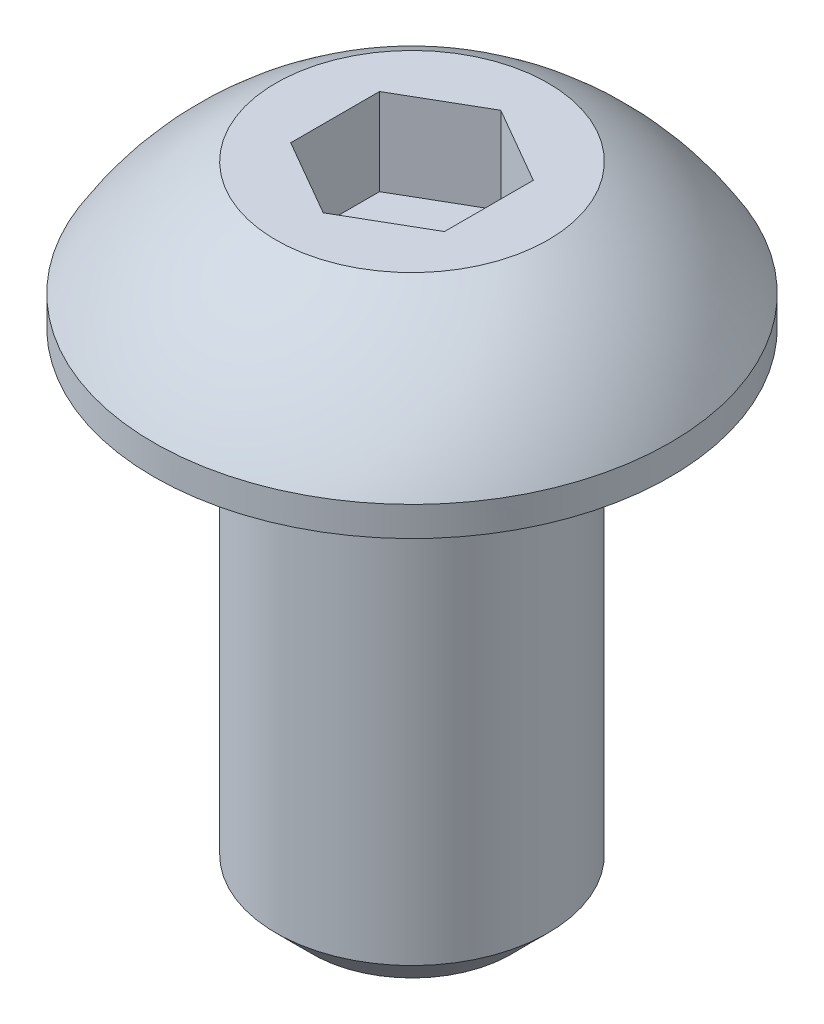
ISO-10303-21;
HEADER;
FILE_DESCRIPTION(('STEP AP214'),'2;1');
FILE_NAME('part.step','',(''),(''),'','','');
FILE_SCHEMA(('AUTOMOTIVE_DESIGN { 1 0 10303 214 1 1 1 1 }'));
ENDSEC;
DATA;
#1=APPLICATION_CONTEXT('core data for automotive mechanical design processes');
#2=APPLICATION_PROTOCOL_DEFINITION('international standard','automotive_design',2000,#1);
#3=PRODUCT_CONTEXT('',#1,'mechanical');
#4=PRODUCT('Part','Part','',(#3));
#5=PRODUCT_RELATED_PRODUCT_CATEGORY('part','',(#4));
#6=PRODUCT_DEFINITION_FORMATION('','',#4);
#7=PRODUCT_DEFINITION_CONTEXT('part definition',#1,'design');
#8=PRODUCT_DEFINITION('design','',#6,#7);
#9=PRODUCT_DEFINITION_SHAPE('','',#8);
#10=(LENGTH_UNIT() NAMED_UNIT(*) SI_UNIT(.MILLI.,.METRE.));
#11=(NAMED_UNIT(*) PLANE_ANGLE_UNIT() SI_UNIT($,.RADIAN.));
#12=(NAMED_UNIT(*) SI_UNIT($,.STERADIAN.) SOLID_ANGLE_UNIT());
#13=UNCERTAINTY_MEASURE_WITH_UNIT(LENGTH_MEASURE(1.E-05),#10,'distance_accuracy_value','');
#14=(GEOMETRIC_REPRESENTATION_CONTEXT(3) GLOBAL_UNCERTAINTY_ASSIGNED_CONTEXT((#13)) GLOBAL_UNIT_ASSIGNED_CONTEXT((#10,
#11,#12)) REPRESENTATION_CONTEXT('',''));
#15=CARTESIAN_POINT('',(0.,0.,0.));
#16=DIRECTION('',(0.,0.,1.));
#17=DIRECTION('',(1.,0.,0.));
#18=AXIS2_PLACEMENT_3D('',#15,#16,#17);
#19=CARTESIAN_POINT('',(0.,0.,0.));
#20=DIRECTION('',(0.,-1.,0.));
#21=DIRECTION('',(0.,0.,-1.));
#22=AXIS2_PLACEMENT_3D('',#19,#20,#21);
#23=PLANE('',#22);
#24=CARTESIAN_POINT('',(0.,0.,0.));
#25=DIRECTION('',(0.,-1.,0.));
#26=DIRECTION('',(0.,0.,-1.));
#27=AXIS2_PLACEMENT_3D('',#24,#25,#26);
#28=CIRCLE('',#27,1.752598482);
#29=CARTESIAN_POINT('',(0.,0.,-1.752598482));
#30=VERTEX_POINT('',#29);
#31=EDGE_CURVE('E11',#30,#30,#28,.T.);
#32=ORIENTED_EDGE('',*,*,#31,.F.);
#33=EDGE_LOOP('',(#32));
#34=FACE_BOUND('',#33,.T.);
#35=CARTESIAN_POINT('',(0.,0.,0.));
#36=DIRECTION('',(0.,-1.,0.));
#37=DIRECTION('',(0.,0.,-1.));
#38=AXIS2_PLACEMENT_3D('',#35,#36,#37);
#39=CIRCLE('',#38,3.327397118);
#40=CARTESIAN_POINT('',(0.,0.,-3.327397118));
#41=VERTEX_POINT('',#40);
#42=EDGE_CURVE('E35',#41,#41,#39,.T.);
#43=ORIENTED_EDGE('',*,*,#42,.T.);
#44=EDGE_LOOP('',(#43));
#45=FACE_BOUND('',#44,.T.);
#46=ADVANCED_FACE('F28',(#34,#45),#23,.T.);
#47=CARTESIAN_POINT('',(0.,0.,0.));
#48=DIRECTION('',(0.,-1.,0.));
#49=DIRECTION('',(0.,0.,-1.));
#50=AXIS2_PLACEMENT_3D('',#47,#48,#49);
#51=CYLINDRICAL_SURFACE('',#50,3.327397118);
#52=CARTESIAN_POINT('',(0.,0.38099967,0.));
#53=DIRECTION('',(0.,-1.,0.));
#54=DIRECTION('',(0.,0.,-1.));
#55=AXIS2_PLACEMENT_3D('',#52,#53,#54);
#56=CIRCLE('',#55,3.327397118);
#57=CARTESIAN_POINT('',(3.327397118,0.38099967,0.));
#58=VERTEX_POINT('',#57);
#59=EDGE_CURVE('E145',#58,#58,#56,.T.);
#60=ORIENTED_EDGE('',*,*,#59,.T.);
#61=EDGE_LOOP('',(#60));
#62=FACE_BOUND('',#61,.T.);
#63=ORIENTED_EDGE('',*,*,#42,.F.);
#64=EDGE_LOOP('',(#63));
#65=FACE_BOUND('',#64,.T.);
#66=ADVANCED_FACE('F151',(#62,#65),#51,.T.);
#67=CARTESIAN_POINT('',(0.,-1.59757103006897,0.));
#68=DIRECTION('',(0.,-1.,0.));
#69=DIRECTION('',(1.,0.,0.));
#70=AXIS2_PLACEMENT_3D('',#67,#68,#69);
#71=SPHERICAL_SURFACE('',#70,3.87121603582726);
#72=CARTESIAN_POINT('',(0.,1.854198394,0.));
#73=DIRECTION('',(0.,-1.,0.));
#74=DIRECTION('',(0.,0.,-1.));
#75=AXIS2_PLACEMENT_3D('',#72,#73,#74);
#76=CIRCLE('',#75,1.752598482);
#77=CARTESIAN_POINT('',(1.752598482,1.854198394,0.));
#78=VERTEX_POINT('',#77);
#79=EDGE_CURVE('E142',#78,#78,#76,.T.);
#80=CARTESIAN_POINT('',(1.752598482,1.854198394,0.));
#81=CARTESIAN_POINT('',(1.77289614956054,1.84389249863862,0.));
#82=CARTESIAN_POINT('',(1.79310289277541,1.833407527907,0.));
#83=CARTESIAN_POINT('',(1.83332828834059,1.81208278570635,0.));
#84=CARTESIAN_POINT('',(1.85334694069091,1.80124301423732,0.));
#85=CARTESIAN_POINT('',(1.89318991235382,1.77921202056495,0.));
#86=CARTESIAN_POINT('',(1.91301423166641,1.76802079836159,0.));
#87=CARTESIAN_POINT('',(1.95246237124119,1.74529039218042,0.));
#88=CARTESIAN_POINT('',(1.97208619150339,1.7337512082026,0.));
#89=CARTESIAN_POINT('',(2.01112722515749,1.71032846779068,0.));
#90=CARTESIAN_POINT('',(2.0305444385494,1.69844491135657,0.));
#91=CARTESIAN_POINT('',(2.06916621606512,1.67433712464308,0.));
#92=CARTESIAN_POINT('',(2.08837078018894,1.66211289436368,0.));
#93=CARTESIAN_POINT('',(2.12656128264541,1.63732756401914,0.));
#94=CARTESIAN_POINT('',(2.14554722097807,1.62476646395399,0.));
#95=CARTESIAN_POINT('',(2.18329456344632,1.5993113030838,0.));
#96=CARTESIAN_POINT('',(2.20205596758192,1.58641724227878,0.));
#97=CARTESIAN_POINT('',(2.23934840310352,1.56030017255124,0.));
#98=CARTESIAN_POINT('',(2.25787943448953,1.54707716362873,0.));
#99=CARTESIAN_POINT('',(2.29470535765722,1.52030631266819,0.));
#100=CARTESIAN_POINT('',(2.3130002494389,1.50675847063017,0.));
#101=CARTESIAN_POINT('',(2.34934820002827,1.47934216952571,0.));
#102=CARTESIAN_POINT('',(2.36740125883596,1.46547371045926,0.));
#103=CARTESIAN_POINT('',(2.40325992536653,1.43742049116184,0.));
#104=CARTESIAN_POINT('',(2.4210655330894,1.42323573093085,0.));
#105=CARTESIAN_POINT('',(2.45642375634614,1.3945543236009,0.));
#106=CARTESIAN_POINT('',(2.47397637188,1.38005767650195,0.));
#107=CARTESIAN_POINT('',(2.50882314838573,1.35075700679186,0.));
#108=CARTESIAN_POINT('',(2.52611730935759,1.33595298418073,0.));
#109=CARTESIAN_POINT('',(2.56044179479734,1.30604217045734,0.));
#110=CARTESIAN_POINT('',(2.57747211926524,1.29093537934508,0.));
#111=CARTESIAN_POINT('',(2.61126363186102,1.260423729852,0.));
#112=CARTESIAN_POINT('',(2.6280248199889,1.24501887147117,0.));
#113=CARTESIAN_POINT('',(2.66127284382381,1.21391588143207,0.));
#114=CARTESIAN_POINT('',(2.67775967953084,1.19821774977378,0.));
#115=CARTESIAN_POINT('',(2.71045386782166,1.16653309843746,0.));
#116=CARTESIAN_POINT('',(2.72666122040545,1.15054657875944,0.));
#117=CARTESIAN_POINT('',(2.75879139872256,1.11829012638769,0.));
#118=CARTESIAN_POINT('',(2.77471422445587,1.10202019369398,0.));
#119=CARTESIAN_POINT('',(2.80627039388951,1.06920197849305,0.));
#120=CARTESIAN_POINT('',(2.82190373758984,1.05265369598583,0.));
#121=CARTESIAN_POINT('',(2.85287607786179,1.01928393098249,0.));
#122=CARTESIAN_POINT('',(2.86821507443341,1.00246244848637,0.));
#123=CARTESIAN_POINT('',(2.89859394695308,0.968551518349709,0.));
#124=CARTESIAN_POINT('',(2.91363382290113,0.951462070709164,0.));
#125=CARTESIAN_POINT('',(2.94340977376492,0.917020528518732,0.));
#126=CARTESIAN_POINT('',(2.95814584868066,0.899668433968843,0.));
#127=CARTESIAN_POINT('',(2.98730961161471,0.864706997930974,0.));
#128=CARTESIAN_POINT('',(3.00173729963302,0.847097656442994,0.));
#129=CARTESIAN_POINT('',(3.03027979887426,0.811627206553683,0.));
#130=CARTESIAN_POINT('',(3.04439461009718,0.793766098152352,0.));
#131=CARTESIAN_POINT('',(3.07230696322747,0.757797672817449,0.));
#132=CARTESIAN_POINT('',(3.08610450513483,0.739690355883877,0.));
#133=CARTESIAN_POINT('',(3.11337802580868,0.703235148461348,0.));
#134=CARTESIAN_POINT('',(3.12685400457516,0.684887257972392,0.));
#135=CARTESIAN_POINT('',(3.15348020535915,0.647956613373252,0.));
#136=CARTESIAN_POINT('',(3.16663042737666,0.629373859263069,0.));
#137=CARTESIAN_POINT('',(3.19260102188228,0.591979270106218,0.));
#138=CARTESIAN_POINT('',(3.2054213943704,0.573167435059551,0.));
#139=CARTESIAN_POINT('',(3.2307283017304,0.535320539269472,0.));
#140=CARTESIAN_POINT('',(3.24321483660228,0.516285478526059,0.));
#141=CARTESIAN_POINT('',(3.26785017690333,0.477998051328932,0.));
#142=CARTESIAN_POINT('',(3.27999898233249,0.458745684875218,0.));
#143=CARTESIAN_POINT('',(3.30395510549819,0.420029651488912,0.));
#144=CARTESIAN_POINT('',(3.31576242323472,0.400565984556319,0.));
#145=CARTESIAN_POINT('',(3.327397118,0.38099967,0.));
#146=B_SPLINE_CURVE_WITH_KNOTS('',3,(#80,#81,#82,#83,#84,#85,#86,#87,#88,#89,#90,#91,#92,#93,
#94,#95,#96,#97,#98,#99,#100,#101,#102,#103,#104,#105,#106,#107,#108,#109,#110,#111,#112,#113,
#114,#115,#116,#117,#118,#119,#120,#121,#122,#123,#124,#125,#126,#127,#128,#129,#130,#131,#132,
#133,#134,#135,#136,#137,#138,#139,#140,#141,#142,#143,#144,#145),.UNSPECIFIED.,.F.,.F.,(4,2,2,
2,2,2,2,2,2,2,2,2,2,2,2,2,2,2,2,2,2,2,2,2,2,2,2,2,2,2,2,2,4),(0.,0.0682915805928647,
0.136583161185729,0.204874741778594,0.273166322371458,0.341457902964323,0.409749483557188,
0.478041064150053,0.546332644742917,0.614624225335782,0.682915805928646,0.751207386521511,
0.819498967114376,0.88779054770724,0.956082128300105,1.02437370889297,1.09266528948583,
1.1609568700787,1.22924845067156,1.29754003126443,1.36583161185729,1.43412319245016,
1.50241477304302,1.57070635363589,1.63899793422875,1.70728951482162,1.77558109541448,
1.84387267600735,1.91216425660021,1.98045583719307,2.04874741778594,2.1170389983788,
2.18533057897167),.UNSPECIFIED.);
#147=EDGE_CURVE('BSEAM153',#78,#58,#146,.T.);
#148=ORIENTED_EDGE('',*,*,#79,.T.);
#149=ORIENTED_EDGE('',*,*,#59,.F.);
#150=ORIENTED_EDGE('',*,*,#147,.T.);
#151=ORIENTED_EDGE('',*,*,#147,.F.);
#152=EDGE_LOOP('',(#148,#150,#149,#151));
#153=FACE_BOUND('',#152,.T.);
#154=ADVANCED_FACE('F153',(#153),#71,.T.);
#155=CARTESIAN_POINT('',(1.752598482,1.854198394,0.));
#156=DIRECTION('',(0.,1.,0.));
#157=DIRECTION('',(0.,0.,1.));
#158=AXIS2_PLACEMENT_3D('',#155,#156,#157);
#159=PLANE('',#158);
#160=DIRECTION('',(0.,0.,1.));
#161=VECTOR('',#160,1.);
#162=CARTESIAN_POINT('',(-0.990599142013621,1.854198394,-0.57192268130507));
#163=LINE('',#162,#161);
#164=CARTESIAN_POINT('',(-0.990599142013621,1.854198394,-0.57192268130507));
#165=VERTEX_POINT('',#164);
#166=CARTESIAN_POINT('',(-0.990599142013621,1.854198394,0.571922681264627));
#167=VERTEX_POINT('',#166);
#168=EDGE_CURVE('E42',#165,#167,#163,.T.);
#169=ORIENTED_EDGE('',*,*,#168,.F.);
#170=DIRECTION('',(-0.866025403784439,0.,0.5));
#171=VECTOR('',#170,1.);
#172=CARTESIAN_POINT('',(-9.72916336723E-12,1.854198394,-1.14384536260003));
#173=LINE('',#172,#171);
#174=CARTESIAN_POINT('',(-9.72916336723E-12,1.854198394,-1.14384536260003));
#175=VERTEX_POINT('',#174);
#176=EDGE_CURVE('E112',#175,#165,#173,.T.);
#177=ORIENTED_EDGE('',*,*,#176,.F.);
#178=DIRECTION('',(-0.866025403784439,0.,-0.5));
#179=VECTOR('',#178,1.);
#180=CARTESIAN_POINT('',(0.990599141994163,1.854198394,-0.57192268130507));
#181=LINE('',#180,#179);
#182=CARTESIAN_POINT('',(0.990599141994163,1.854198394,-0.57192268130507));
#183=VERTEX_POINT('',#182);
#184=EDGE_CURVE('E106',#183,#175,#181,.T.);
#185=ORIENTED_EDGE('',*,*,#184,.F.);
#186=DIRECTION('',(0.,0.,-1.));
#187=VECTOR('',#186,1.);
#188=CARTESIAN_POINT('',(0.990599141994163,1.854198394,0.571922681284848));
#189=LINE('',#188,#187);
#190=CARTESIAN_POINT('',(0.990599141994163,1.854198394,0.571922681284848));
#191=VERTEX_POINT('',#190);
#192=EDGE_CURVE('E104',#191,#183,#189,.T.);
#193=ORIENTED_EDGE('',*,*,#192,.F.);
#194=DIRECTION('',(0.866025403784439,0.,-0.5));
#195=VECTOR('',#194,1.);
#196=CARTESIAN_POINT('',(-9.72908120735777E-12,1.854198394,1.14384536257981));
#197=LINE('',#196,#195);
#198=CARTESIAN_POINT('',(-9.72908120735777E-12,1.854198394,1.14384536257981));
#199=VERTEX_POINT('',#198);
#200=EDGE_CURVE('E85',#199,#191,#197,.T.);
#201=ORIENTED_EDGE('',*,*,#200,.F.);
#202=DIRECTION('',(0.866025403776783,0.,0.500000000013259));
#203=VECTOR('',#202,1.);
#204=CARTESIAN_POINT('',(-0.990599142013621,1.854198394,0.571922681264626));
#205=LINE('',#204,#203);
#206=EDGE_CURVE('E96',#167,#199,#205,.T.);
#207=ORIENTED_EDGE('',*,*,#206,.F.);
#208=EDGE_LOOP('',(#169,#177,#185,#193,#201,#207));
#209=FACE_BOUND('',#208,.T.);
#210=ORIENTED_EDGE('',*,*,#79,.F.);
#211=EDGE_LOOP('',(#210));
#212=FACE_BOUND('',#211,.T.);
#213=ADVANCED_FACE('F100',(#209,#212),#159,.T.);
#214=CARTESIAN_POINT('',(0.,-6.3499945,0.));
#215=DIRECTION('',(0.,-1.,0.));
#216=DIRECTION('',(0.,0.,-1.));
#217=AXIS2_PLACEMENT_3D('',#214,#215,#216);
#218=PLANE('',#217);
#219=CARTESIAN_POINT('',(0.,-6.3499945,0.));
#220=DIRECTION('',(0.,-1.,0.));
#221=DIRECTION('',(0.,0.,-1.));
#222=AXIS2_PLACEMENT_3D('',#219,#220,#221);
#223=CIRCLE('',#222,1.2801588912);
#224=CARTESIAN_POINT('',(0.,-6.3499945,-1.2801588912));
#225=VERTEX_POINT('',#224);
#226=EDGE_CURVE('E139',#225,#225,#223,.T.);
#227=ORIENTED_EDGE('',*,*,#226,.T.);
#228=EDGE_LOOP('',(#227));
#229=FACE_BOUND('',#228,.T.);
#230=ADVANCED_FACE('F165',(#229),#218,.T.);
#231=CARTESIAN_POINT('',(0.,-6.3499945,0.));
#232=DIRECTION('',(0.,1.,0.));
#233=DIRECTION('',(0.,0.,1.));
#234=AXIS2_PLACEMENT_3D('',#231,#232,#233);
#235=CONICAL_SURFACE('',#234,1.2801588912,0.785398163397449);
#236=CARTESIAN_POINT('',(0.,-5.8775549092,0.));
#237=DIRECTION('',(0.,-1.,0.));
#238=DIRECTION('',(0.,0.,-1.));
#239=AXIS2_PLACEMENT_3D('',#236,#237,#238);
#240=CIRCLE('',#239,1.752598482);
#241=CARTESIAN_POINT('',(0.,-5.8775549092,-1.752598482));
#242=VERTEX_POINT('',#241);
#243=EDGE_CURVE('E130',#242,#242,#240,.T.);
#244=ORIENTED_EDGE('',*,*,#243,.T.);
#245=EDGE_LOOP('',(#244));
#246=FACE_BOUND('',#245,.T.);
#247=ORIENTED_EDGE('',*,*,#226,.F.);
#248=EDGE_LOOP('',(#247));
#249=FACE_BOUND('',#248,.T.);
#250=ADVANCED_FACE('F168',(#246,#249),#235,.T.);
#251=CARTESIAN_POINT('',(0.,0.,0.));
#252=DIRECTION('',(0.,-1.,0.));
#253=DIRECTION('',(0.,0.,-1.));
#254=AXIS2_PLACEMENT_3D('',#251,#252,#253);
#255=CYLINDRICAL_SURFACE('',#254,1.752598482);
#256=ORIENTED_EDGE('',*,*,#31,.T.);
#257=EDGE_LOOP('',(#256));
#258=FACE_BOUND('',#257,.T.);
#259=ORIENTED_EDGE('',*,*,#243,.F.);
#260=EDGE_LOOP('',(#259));
#261=FACE_BOUND('',#260,.T.);
#262=ADVANCED_FACE('F172',(#258,#261),#255,.T.);
#263=CARTESIAN_POINT('',(-0.990599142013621,0.736599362,-0.57192268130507));
#264=DIRECTION('',(-1.,0.,0.));
#265=DIRECTION('',(0.,0.,1.));
#266=AXIS2_PLACEMENT_3D('',#263,#264,#265);
#267=PLANE('',#266);
#268=ORIENTED_EDGE('',*,*,#168,.T.);
#269=DIRECTION('',(0.,1.,0.));
#270=VECTOR('',#269,1.);
#271=CARTESIAN_POINT('',(-0.990599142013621,0.736599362,0.571922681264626));
#272=LINE('',#271,#270);
#273=CARTESIAN_POINT('',(-0.990599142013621,0.736599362,0.571922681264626));
#274=VERTEX_POINT('',#273);
#275=EDGE_CURVE('E93',#274,#167,#272,.T.);
#276=ORIENTED_EDGE('',*,*,#275,.F.);
#277=DIRECTION('',(0.,0.,1.));
#278=VECTOR('',#277,1.);
#279=CARTESIAN_POINT('',(-0.990599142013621,0.736599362,-0.57192268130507));
#280=LINE('',#279,#278);
#281=CARTESIAN_POINT('',(-0.990599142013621,0.736599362,-0.57192268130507));
#282=VERTEX_POINT('',#281);
#283=EDGE_CURVE('E114',#282,#274,#280,.T.);
#284=ORIENTED_EDGE('',*,*,#283,.F.);
#285=DIRECTION('',(0.,1.,0.));
#286=VECTOR('',#285,1.);
#287=CARTESIAN_POINT('',(-0.990599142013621,0.736599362,-0.57192268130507));
#288=LINE('',#287,#286);
#289=EDGE_CURVE('E49',#282,#165,#288,.T.);
#290=ORIENTED_EDGE('',*,*,#289,.T.);
#291=EDGE_LOOP('',(#268,#276,#284,#290));
#292=FACE_BOUND('',#291,.T.);
#293=ADVANCED_FACE('F176',(#292),#267,.F.);
#294=CARTESIAN_POINT('',(-9.72916336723E-12,0.736599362,-1.14384536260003));
#295=DIRECTION('',(-0.5,0.,-0.866025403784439));
#296=DIRECTION('',(-0.866025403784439,0.,0.5));
#297=AXIS2_PLACEMENT_3D('',#294,#295,#296);
#298=PLANE('',#297);
#299=ORIENTED_EDGE('',*,*,#176,.T.);
#300=ORIENTED_EDGE('',*,*,#289,.F.);
#301=DIRECTION('',(-0.866025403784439,0.,0.5));
#302=VECTOR('',#301,1.);
#303=CARTESIAN_POINT('',(-9.72916336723E-12,0.736599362,-1.14384536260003));
#304=LINE('',#303,#302);
#305=CARTESIAN_POINT('',(-9.72916336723E-12,0.736599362,-1.14384536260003));
#306=VERTEX_POINT('',#305);
#307=EDGE_CURVE('E126',#306,#282,#304,.T.);
#308=ORIENTED_EDGE('',*,*,#307,.F.);
#309=DIRECTION('',(0.,1.,0.));
#310=VECTOR('',#309,1.);
#311=CARTESIAN_POINT('',(-9.72916336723E-12,0.736599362,-1.14384536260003));
#312=LINE('',#311,#310);
#313=EDGE_CURVE('E131',#306,#175,#312,.T.);
#314=ORIENTED_EDGE('',*,*,#313,.T.);
#315=EDGE_LOOP('',(#299,#300,#308,#314));
#316=FACE_BOUND('',#315,.T.);
#317=ADVANCED_FACE('F180',(#316),#298,.F.);
#318=CARTESIAN_POINT('',(0.990599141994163,0.736599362,-0.57192268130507));
#319=DIRECTION('',(0.5,0.,-0.866025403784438));
#320=DIRECTION('',(-0.866025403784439,0.,-0.5));
#321=AXIS2_PLACEMENT_3D('',#318,#319,#320);
#322=PLANE('',#321);
#323=ORIENTED_EDGE('',*,*,#184,.T.);
#324=ORIENTED_EDGE('',*,*,#313,.F.);
#325=DIRECTION('',(-0.866025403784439,0.,-0.5));
#326=VECTOR('',#325,1.);
#327=CARTESIAN_POINT('',(0.990599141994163,0.736599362,-0.57192268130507));
#328=LINE('',#327,#326);
#329=CARTESIAN_POINT('',(0.990599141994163,0.736599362,-0.57192268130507));
#330=VERTEX_POINT('',#329);
#331=EDGE_CURVE('E123',#330,#306,#328,.T.);
#332=ORIENTED_EDGE('',*,*,#331,.F.);
#333=DIRECTION('',(0.,1.,0.));
#334=VECTOR('',#333,1.);
#335=CARTESIAN_POINT('',(0.990599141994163,0.736599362,-0.57192268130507));
#336=LINE('',#335,#334);
#337=EDGE_CURVE('E133',#330,#183,#336,.T.);
#338=ORIENTED_EDGE('',*,*,#337,.T.);
#339=EDGE_LOOP('',(#323,#324,#332,#338));
#340=FACE_BOUND('',#339,.T.);
#341=ADVANCED_FACE('F189',(#340),#322,.F.);
#342=CARTESIAN_POINT('',(0.990599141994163,0.736599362,0.571922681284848));
#343=DIRECTION('',(1.,0.,0.));
#344=DIRECTION('',(0.,0.,-1.));
#345=AXIS2_PLACEMENT_3D('',#342,#343,#344);
#346=PLANE('',#345);
#347=ORIENTED_EDGE('',*,*,#192,.T.);
#348=ORIENTED_EDGE('',*,*,#337,.F.);
#349=DIRECTION('',(0.,0.,-1.));
#350=VECTOR('',#349,1.);
#351=CARTESIAN_POINT('',(0.990599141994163,0.736599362,0.571922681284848));
#352=LINE('',#351,#350);
#353=CARTESIAN_POINT('',(0.990599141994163,0.736599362,0.571922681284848));
#354=VERTEX_POINT('',#353);
#355=EDGE_CURVE('E120',#354,#330,#352,.T.);
#356=ORIENTED_EDGE('',*,*,#355,.F.);
#357=DIRECTION('',(0.,1.,0.));
#358=VECTOR('',#357,1.);
#359=CARTESIAN_POINT('',(0.990599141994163,0.736599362,0.571922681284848));
#360=LINE('',#359,#358);
#361=EDGE_CURVE('E92',#354,#191,#360,.T.);
#362=ORIENTED_EDGE('',*,*,#361,.T.);
#363=EDGE_LOOP('',(#347,#348,#356,#362));
#364=FACE_BOUND('',#363,.T.);
#365=ADVANCED_FACE('F186',(#364),#346,.F.);
#366=CARTESIAN_POINT('',(-9.72908120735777E-12,0.736599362,1.14384536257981));
#367=DIRECTION('',(0.5,0.,0.866025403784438));
#368=DIRECTION('',(0.866025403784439,0.,-0.5));
#369=AXIS2_PLACEMENT_3D('',#366,#367,#368);
#370=PLANE('',#369);
#371=ORIENTED_EDGE('',*,*,#200,.T.);
#372=ORIENTED_EDGE('',*,*,#361,.F.);
#373=DIRECTION('',(0.866025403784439,0.,-0.5));
#374=VECTOR('',#373,1.);
#375=CARTESIAN_POINT('',(-9.72908120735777E-12,0.736599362,1.14384536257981));
#376=LINE('',#375,#374);
#377=CARTESIAN_POINT('',(-9.72908120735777E-12,0.736599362,1.14384536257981));
#378=VERTEX_POINT('',#377);
#379=EDGE_CURVE('E88',#378,#354,#376,.T.);
#380=ORIENTED_EDGE('',*,*,#379,.F.);
#381=DIRECTION('',(0.,1.,0.));
#382=VECTOR('',#381,1.);
#383=CARTESIAN_POINT('',(-9.72908120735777E-12,0.736599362,1.14384536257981));
#384=LINE('',#383,#382);
#385=EDGE_CURVE('E81',#378,#199,#384,.T.);
#386=ORIENTED_EDGE('',*,*,#385,.T.);
#387=EDGE_LOOP('',(#371,#372,#380,#386));
#388=FACE_BOUND('',#387,.T.);
#389=ADVANCED_FACE('F83',(#388),#370,.F.);
#390=CARTESIAN_POINT('',(-0.990599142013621,0.736599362,0.571922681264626));
#391=DIRECTION('',(-0.500000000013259,0.,0.866025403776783));
#392=DIRECTION('',(0.866025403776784,0.,0.500000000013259));
#393=AXIS2_PLACEMENT_3D('',#390,#391,#392);
#394=PLANE('',#393);
#395=ORIENTED_EDGE('',*,*,#206,.T.);
#396=ORIENTED_EDGE('',*,*,#385,.F.);
#397=DIRECTION('',(0.866025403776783,0.,0.500000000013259));
#398=VECTOR('',#397,1.);
#399=CARTESIAN_POINT('',(-0.990599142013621,0.736599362,0.571922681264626));
#400=LINE('',#399,#398);
#401=EDGE_CURVE('E117',#274,#378,#400,.T.);
#402=ORIENTED_EDGE('',*,*,#401,.F.);
#403=ORIENTED_EDGE('',*,*,#275,.T.);
#404=EDGE_LOOP('',(#395,#396,#402,#403));
#405=FACE_BOUND('',#404,.T.);
#406=ADVANCED_FACE('F97',(#405),#394,.F.);
#407=CARTESIAN_POINT('',(-0.990599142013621,0.736599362,-0.57192268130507));
#408=DIRECTION('',(0.,-1.,0.));
#409=DIRECTION('',(0.,0.,-1.));
#410=AXIS2_PLACEMENT_3D('',#407,#408,#409);
#411=PLANE('',#410);
#412=ORIENTED_EDGE('',*,*,#283,.T.);
#413=ORIENTED_EDGE('',*,*,#401,.T.);
#414=ORIENTED_EDGE('',*,*,#379,.T.);
#415=ORIENTED_EDGE('',*,*,#355,.T.);
#416=ORIENTED_EDGE('',*,*,#331,.T.);
#417=ORIENTED_EDGE('',*,*,#307,.T.);
#418=EDGE_LOOP('',(#412,#413,#414,#415,#416,#417));
#419=FACE_BOUND('',#418,.T.);
#420=ADVANCED_FACE('F183',(#419),#411,.F.);
#421=CLOSED_SHELL('',(#46,#66,#154,#213,#230,#250,#262,#293,#317,#341,#365,#389,#406,#420));
#422=MANIFOLD_SOLID_BREP('B2',#421);
#423=ADVANCED_BREP_SHAPE_REPRESENTATION('',(#18,#422),#14);
#424=SHAPE_DEFINITION_REPRESENTATION(#9,#423);
ENDSEC;
END-ISO-10303-21;
